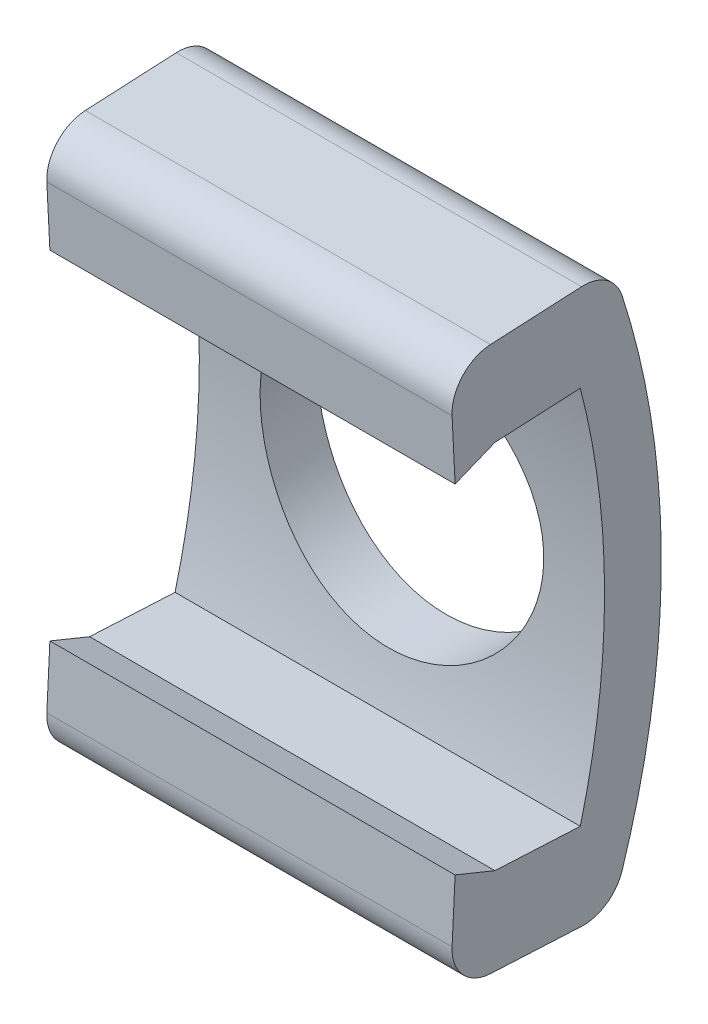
from build123d import *

# Parameters (mm, degrees)
EXTRUDE_1_DEPTH     = 5
SKETCH_2_R          = 3.5
CUT_EXTRUDE_1_DEPTH = 10.920132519


with BuildPart() as part:
    # Sketch 1 → Extrude 1 (new, symmetric)
    with BuildSketch(Plane(origin=(0, 0, 0), x_dir=(0, 0, -1), z_dir=(1, 0, 0))):
        with BuildLine():
            Line((-5.087734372, -4.175898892), (-5.162872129, -5.674015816))
            ThreePointArc((-5.162872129, -5.674015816), (-4.905766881, -6.394906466), (-4.21421935, -6.722852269))
            Line((-4.21421935, -6.722852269), (-1.968813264, -6.835470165))
            ThreePointArc((-1.968813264, -6.835470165), (-1.350601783, -6.65967152), (-0.967075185, -6.14392163))
            ThreePointArc((-0.967075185, -6.14392163), (-0.243248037, -3.109783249), (0, 0))
            ThreePointArc((0, 0), (-0.243248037, 3.109783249), (-0.967075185, 6.14392163))
            ThreePointArc((-0.967075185, 6.14392163), (-1.350601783, 6.65967152), (-1.968813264, 6.835470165))
            Line((-1.968813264, 6.835470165), (-4.21421935, 6.722852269))
            ThreePointArc((-4.21421935, 6.722852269), (-4.905766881, 6.394906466), (-5.162872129, 5.674015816))
            Line((-5.162872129, 5.674015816), (-5.087734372, 4.175898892))
            Line((-5.087734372, 4.175898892), (-4.1065219, 4.575551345))
            Line((-4.1065219, 4.575551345), (-1.998729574, 4.68126725))
            ThreePointArc((-1.998729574, 4.68126725), (-1.55028957, 2.359700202), (-1.4, 0))
            ThreePointArc((-1.4, 0), (-1.55028957, -2.359700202), (-1.998729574, -4.68126725))
            Line((-1.998729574, -4.68126725), (-4.1065219, -4.575551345))
            Line((-4.1065219, -4.575551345), (-5.087734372, -4.175898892))
        make_face()
    extrude(amount=EXTRUDE_1_DEPTH, both=True)

    # Sketch 2 → Cut-Extrude 1 (cut, through all)
    with BuildSketch(Plane.XY):
        with Locations(Location((0, 0, 0), (0, 0, 180))):
            Circle(SKETCH_2_R)
    extrude(amount=CUT_EXTRUDE_1_DEPTH, mode=Mode.SUBTRACT)


solid = part.part
